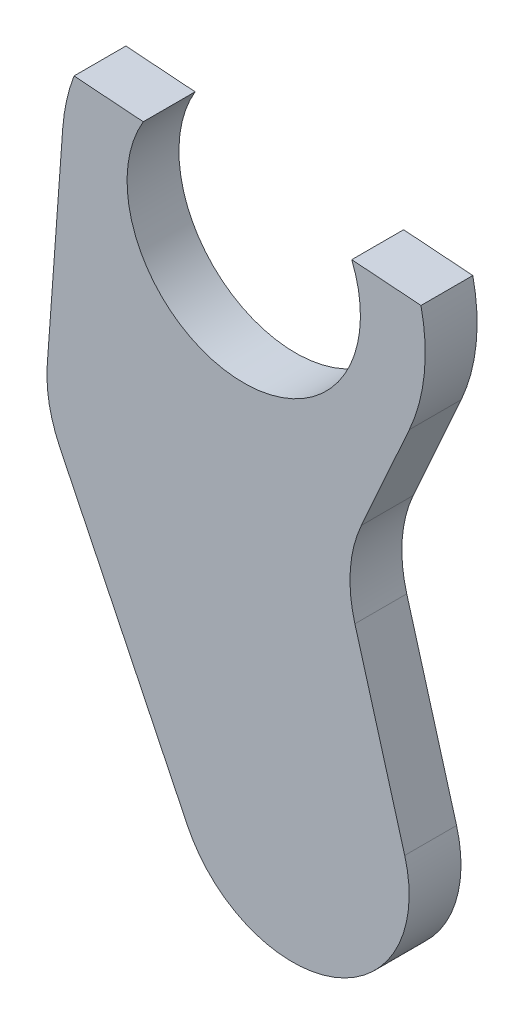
ISO-10303-21;
HEADER;
FILE_DESCRIPTION(('STEP AP214'),'2;1');
FILE_NAME('part.step','',(''),(''),'','','');
FILE_SCHEMA(('AUTOMOTIVE_DESIGN { 1 0 10303 214 1 1 1 1 }'));
ENDSEC;
DATA;
#1=APPLICATION_CONTEXT('core data for automotive mechanical design processes');
#2=APPLICATION_PROTOCOL_DEFINITION('international standard','automotive_design',2000,#1);
#3=PRODUCT_CONTEXT('',#1,'mechanical');
#4=PRODUCT('Part','Part','',(#3));
#5=PRODUCT_RELATED_PRODUCT_CATEGORY('part','',(#4));
#6=PRODUCT_DEFINITION_FORMATION('','',#4);
#7=PRODUCT_DEFINITION_CONTEXT('part definition',#1,'design');
#8=PRODUCT_DEFINITION('design','',#6,#7);
#9=PRODUCT_DEFINITION_SHAPE('','',#8);
#10=(LENGTH_UNIT() NAMED_UNIT(*) SI_UNIT(.MILLI.,.METRE.));
#11=(NAMED_UNIT(*) PLANE_ANGLE_UNIT() SI_UNIT($,.RADIAN.));
#12=(NAMED_UNIT(*) SI_UNIT($,.STERADIAN.) SOLID_ANGLE_UNIT());
#13=UNCERTAINTY_MEASURE_WITH_UNIT(LENGTH_MEASURE(1.E-05),#10,'distance_accuracy_value','');
#14=(GEOMETRIC_REPRESENTATION_CONTEXT(3) GLOBAL_UNCERTAINTY_ASSIGNED_CONTEXT((#13)) GLOBAL_UNIT_ASSIGNED_CONTEXT((#10,
#11,#12)) REPRESENTATION_CONTEXT('',''));
#15=CARTESIAN_POINT('',(0.,0.,0.));
#16=DIRECTION('',(0.,0.,1.));
#17=DIRECTION('',(1.,0.,0.));
#18=AXIS2_PLACEMENT_3D('',#15,#16,#17);
#19=CARTESIAN_POINT('',(-3.87501606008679,2.28784845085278,2.));
#20=DIRECTION('',(-0.0727199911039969,-0.997352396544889,0.));
#21=DIRECTION('',(0.99735239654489,-0.0727199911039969,0.));
#22=AXIS2_PLACEMENT_3D('',#19,#20,#21);
#23=PLANE('',#22);
#24=DIRECTION('',(-0.997352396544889,0.0727199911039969,0.));
#25=VECTOR('',#24,1.);
#26=CARTESIAN_POINT('',(-3.87501606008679,2.28784845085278,0.));
#27=LINE('',#26,#25);
#28=CARTESIAN_POINT('',(-3.87501606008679,2.28784845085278,0.));
#29=VERTEX_POINT('',#28);
#30=CARTESIAN_POINT('',(-6.54500328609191,2.48252532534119,0.));
#31=VERTEX_POINT('',#30);
#32=EDGE_CURVE('E94',#29,#31,#27,.T.);
#33=ORIENTED_EDGE('',*,*,#32,.T.);
#34=DIRECTION('',(0.,0.,-1.));
#35=VECTOR('',#34,1.);
#36=CARTESIAN_POINT('',(-6.54500328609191,2.48252532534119,2.));
#37=LINE('',#36,#35);
#38=CARTESIAN_POINT('',(-6.54500328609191,2.48252532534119,2.));
#39=VERTEX_POINT('',#38);
#40=EDGE_CURVE('E46',#39,#31,#37,.T.);
#41=ORIENTED_EDGE('',*,*,#40,.F.);
#42=DIRECTION('',(-0.997352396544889,0.0727199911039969,0.));
#43=VECTOR('',#42,1.);
#44=CARTESIAN_POINT('',(-3.87501606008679,2.28784845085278,2.));
#45=LINE('',#44,#43);
#46=CARTESIAN_POINT('',(-3.87501606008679,2.28784845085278,2.));
#47=VERTEX_POINT('',#46);
#48=EDGE_CURVE('E136',#47,#39,#45,.T.);
#49=ORIENTED_EDGE('',*,*,#48,.F.);
#50=DIRECTION('',(0.,0.,-1.));
#51=VECTOR('',#50,1.);
#52=CARTESIAN_POINT('',(-3.87501606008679,2.28784845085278,2.));
#53=LINE('',#52,#51);
#54=EDGE_CURVE('E11',#47,#29,#53,.T.);
#55=ORIENTED_EDGE('',*,*,#54,.T.);
#56=EDGE_LOOP('',(#33,#41,#49,#55));
#57=FACE_BOUND('',#56,.T.);
#58=ADVANCED_FACE('F36',(#57),#23,.F.);
#59=CARTESIAN_POINT('',(-1.97494798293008E-10,7.49122985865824E-11,2.));
#60=DIRECTION('',(0.,0.,-1.));
#61=DIRECTION('',(-1.,0.,0.));
#62=AXIS2_PLACEMENT_3D('',#59,#60,#61);
#63=CYLINDRICAL_SURFACE('',#62,7.00000000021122);
#64=CARTESIAN_POINT('',(-1.97494798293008E-10,7.49122985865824E-11,0.));
#65=DIRECTION('',(0.,0.,1.));
#66=DIRECTION('',(1.,0.,0.));
#67=AXIS2_PLACEMENT_3D('',#64,#65,#66);
#68=CIRCLE('',#67,7.00000000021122);
#69=CARTESIAN_POINT('',(-6.98146677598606,0.509039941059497,0.));
#70=VERTEX_POINT('',#69);
#71=EDGE_CURVE('E143',#31,#70,#68,.T.);
#72=ORIENTED_EDGE('',*,*,#71,.T.);
#73=DIRECTION('',(0.,0.,-1.));
#74=VECTOR('',#73,1.);
#75=CARTESIAN_POINT('',(-6.98146677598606,0.509039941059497,2.));
#76=LINE('',#75,#74);
#77=CARTESIAN_POINT('',(-6.98146677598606,0.509039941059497,2.));
#78=VERTEX_POINT('',#77);
#79=EDGE_CURVE('E140',#78,#70,#76,.T.);
#80=ORIENTED_EDGE('',*,*,#79,.F.);
#81=CARTESIAN_POINT('',(-1.97494798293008E-10,7.49122985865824E-11,2.));
#82=DIRECTION('',(0.,0.,1.));
#83=DIRECTION('',(1.,0.,0.));
#84=AXIS2_PLACEMENT_3D('',#81,#82,#83);
#85=CIRCLE('',#84,7.00000000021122);
#86=EDGE_CURVE('E130',#39,#78,#85,.T.);
#87=ORIENTED_EDGE('',*,*,#86,.F.);
#88=ORIENTED_EDGE('',*,*,#40,.T.);
#89=EDGE_LOOP('',(#72,#80,#87,#88));
#90=FACE_BOUND('',#89,.T.);
#91=ADVANCED_FACE('F141',(#90),#63,.T.);
#92=CARTESIAN_POINT('',(-6.98146677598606,0.509039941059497,2.));
#93=DIRECTION('',(0.997352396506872,-0.0727199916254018,0.));
#94=DIRECTION('',(0.0727199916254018,0.997352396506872,0.));
#95=AXIS2_PLACEMENT_3D('',#92,#93,#94);
#96=PLANE('',#95);
#97=DIRECTION('',(-0.0727199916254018,-0.997352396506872,0.));
#98=VECTOR('',#97,1.);
#99=CARTESIAN_POINT('',(-6.98146677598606,0.509039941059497,0.));
#100=LINE('',#99,#98);
#101=CARTESIAN_POINT('',(-7.57707677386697,-7.65973243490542,0.));
#102=VERTEX_POINT('',#101);
#103=EDGE_CURVE('E178',#70,#102,#100,.T.);
#104=ORIENTED_EDGE('',*,*,#103,.T.);
#105=DIRECTION('',(0.,0.,-1.));
#106=VECTOR('',#105,1.);
#107=CARTESIAN_POINT('',(-7.57707677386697,-7.65973243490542,2.));
#108=LINE('',#107,#106);
#109=CARTESIAN_POINT('',(-7.57707677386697,-7.65973243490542,2.));
#110=VERTEX_POINT('',#109);
#111=EDGE_CURVE('E146',#110,#102,#108,.T.);
#112=ORIENTED_EDGE('',*,*,#111,.F.);
#113=DIRECTION('',(-0.0727199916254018,-0.997352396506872,0.));
#114=VECTOR('',#113,1.);
#115=CARTESIAN_POINT('',(-6.98146677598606,0.509039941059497,2.));
#116=LINE('',#115,#114);
#117=EDGE_CURVE('E134',#78,#110,#116,.T.);
#118=ORIENTED_EDGE('',*,*,#117,.F.);
#119=ORIENTED_EDGE('',*,*,#79,.T.);
#120=EDGE_LOOP('',(#104,#112,#118,#119));
#121=FACE_BOUND('',#120,.T.);
#122=ADVANCED_FACE('F148',(#121),#96,.F.);
#123=CARTESIAN_POINT('',(-2.59031479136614,-8.02333239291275,2.));
#124=DIRECTION('',(0.,0.,-1.));
#125=DIRECTION('',(-1.,0.,0.));
#126=AXIS2_PLACEMENT_3D('',#123,#124,#125);
#127=CYLINDRICAL_SURFACE('',#126,4.99999999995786);
#128=CARTESIAN_POINT('',(-2.59031479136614,-8.02333239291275,0.));
#129=DIRECTION('',(0.,0.,1.));
#130=DIRECTION('',(1.,0.,0.));
#131=AXIS2_PLACEMENT_3D('',#128,#129,#130);
#132=CIRCLE('',#131,4.99999999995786);
#133=CARTESIAN_POINT('',(-7.09077732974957,-10.2018265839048,0.));
#134=VERTEX_POINT('',#133);
#135=EDGE_CURVE('E176',#102,#134,#132,.T.);
#136=ORIENTED_EDGE('',*,*,#135,.T.);
#137=DIRECTION('',(0.,0.,-1.));
#138=VECTOR('',#137,1.);
#139=CARTESIAN_POINT('',(-7.09077732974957,-10.2018265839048,2.));
#140=LINE('',#139,#138);
#141=CARTESIAN_POINT('',(-7.09077732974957,-10.2018265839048,2.));
#142=VERTEX_POINT('',#141);
#143=EDGE_CURVE('E184',#142,#134,#140,.T.);
#144=ORIENTED_EDGE('',*,*,#143,.F.);
#145=CARTESIAN_POINT('',(-2.59031479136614,-8.02333239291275,2.));
#146=DIRECTION('',(0.,0.,1.));
#147=DIRECTION('',(1.,0.,0.));
#148=AXIS2_PLACEMENT_3D('',#145,#146,#147);
#149=CIRCLE('',#148,4.99999999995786);
#150=EDGE_CURVE('E151',#110,#142,#149,.T.);
#151=ORIENTED_EDGE('',*,*,#150,.F.);
#152=ORIENTED_EDGE('',*,*,#111,.T.);
#153=EDGE_LOOP('',(#136,#144,#151,#152));
#154=FACE_BOUND('',#153,.T.);
#155=ADVANCED_FACE('F213',(#154),#127,.T.);
#156=CARTESIAN_POINT('',(-7.09077732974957,-10.2018265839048,2.));
#157=DIRECTION('',(0.900092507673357,0.435698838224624,0.));
#158=DIRECTION('',(-0.435698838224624,0.900092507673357,0.));
#159=AXIS2_PLACEMENT_3D('',#156,#157,#158);
#160=PLANE('',#159);
#161=DIRECTION('',(0.435698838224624,-0.900092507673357,0.));
#162=VECTOR('',#161,1.);
#163=CARTESIAN_POINT('',(-7.09077732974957,-10.2018265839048,0.));
#164=LINE('',#163,#162);
#165=CARTESIAN_POINT('',(-2.17133946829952,-20.3646931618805,0.));
#166=VERTEX_POINT('',#165);
#167=EDGE_CURVE('E174',#134,#166,#164,.T.);
#168=ORIENTED_EDGE('',*,*,#167,.T.);
#169=DIRECTION('',(0.,0.,-1.));
#170=VECTOR('',#169,1.);
#171=CARTESIAN_POINT('',(-2.17133946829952,-20.3646931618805,2.));
#172=LINE('',#171,#170);
#173=CARTESIAN_POINT('',(-2.17133946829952,-20.3646931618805,2.));
#174=VERTEX_POINT('',#173);
#175=EDGE_CURVE('E187',#174,#166,#172,.T.);
#176=ORIENTED_EDGE('',*,*,#175,.F.);
#177=DIRECTION('',(0.435698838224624,-0.900092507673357,0.));
#178=VECTOR('',#177,1.);
#179=CARTESIAN_POINT('',(-7.09077732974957,-10.2018265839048,2.));
#180=LINE('',#179,#178);
#181=EDGE_CURVE('E153',#142,#174,#180,.T.);
#182=ORIENTED_EDGE('',*,*,#181,.F.);
#183=ORIENTED_EDGE('',*,*,#143,.T.);
#184=EDGE_LOOP('',(#168,#176,#182,#183));
#185=FACE_BOUND('',#184,.T.);
#186=ADVANCED_FACE('F221',(#185),#160,.F.);
#187=CARTESIAN_POINT('',(1.87907681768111,-18.4040483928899,2.));
#188=DIRECTION('',(0.,0.,-1.));
#189=DIRECTION('',(-1.,0.,0.));
#190=AXIS2_PLACEMENT_3D('',#187,#188,#189);
#191=CYLINDRICAL_SURFACE('',#190,4.49999999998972);
#192=CARTESIAN_POINT('',(1.87907681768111,-18.4040483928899,0.));
#193=DIRECTION('',(0.,0.,1.));
#194=DIRECTION('',(1.,0.,0.));
#195=AXIS2_PLACEMENT_3D('',#192,#193,#194);
#196=CIRCLE('',#195,4.49999999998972);
#197=CARTESIAN_POINT('',(6.20842056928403,-17.1765376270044,0.));
#198=VERTEX_POINT('',#197);
#199=EDGE_CURVE('E172',#166,#198,#196,.T.);
#200=ORIENTED_EDGE('',*,*,#199,.T.);
#201=DIRECTION('',(0.,0.,-1.));
#202=VECTOR('',#201,1.);
#203=CARTESIAN_POINT('',(6.20842056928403,-17.1765376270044,2.));
#204=LINE('',#203,#202);
#205=CARTESIAN_POINT('',(6.20842056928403,-17.1765376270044,2.));
#206=VERTEX_POINT('',#205);
#207=EDGE_CURVE('E190',#206,#198,#204,.T.);
#208=ORIENTED_EDGE('',*,*,#207,.F.);
#209=CARTESIAN_POINT('',(1.87907681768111,-18.4040483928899,2.));
#210=DIRECTION('',(0.,0.,1.));
#211=DIRECTION('',(1.,0.,0.));
#212=AXIS2_PLACEMENT_3D('',#209,#210,#211);
#213=CIRCLE('',#212,4.49999999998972);
#214=EDGE_CURVE('E218',#174,#206,#213,.T.);
#215=ORIENTED_EDGE('',*,*,#214,.F.);
#216=ORIENTED_EDGE('',*,*,#175,.T.);
#217=EDGE_LOOP('',(#200,#208,#215,#216));
#218=FACE_BOUND('',#217,.T.);
#219=ADVANCED_FACE('F224',(#218),#191,.T.);
#220=CARTESIAN_POINT('',(6.20842056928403,-17.1765376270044,2.));
#221=DIRECTION('',(-0.962076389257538,-0.272780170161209,0.));
#222=DIRECTION('',(0.272780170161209,-0.962076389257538,0.));
#223=AXIS2_PLACEMENT_3D('',#220,#221,#222);
#224=PLANE('',#223);
#225=DIRECTION('',(-0.272780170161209,0.962076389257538,0.));
#226=VECTOR('',#225,1.);
#227=CARTESIAN_POINT('',(6.20842056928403,-17.1765376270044,0.));
#228=LINE('',#227,#226);
#229=CARTESIAN_POINT('',(4.28717341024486,-10.4004346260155,0.));
#230=VERTEX_POINT('',#229);
#231=EDGE_CURVE('E169',#198,#230,#228,.T.);
#232=ORIENTED_EDGE('',*,*,#231,.T.);
#233=DIRECTION('',(0.,0.,-1.));
#234=VECTOR('',#233,1.);
#235=CARTESIAN_POINT('',(4.28717341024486,-10.4004346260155,2.));
#236=LINE('',#235,#234);
#237=CARTESIAN_POINT('',(4.28717341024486,-10.4004346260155,2.));
#238=VERTEX_POINT('',#237);
#239=EDGE_CURVE('E193',#238,#230,#236,.T.);
#240=ORIENTED_EDGE('',*,*,#239,.F.);
#241=DIRECTION('',(-0.272780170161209,0.962076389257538,0.));
#242=VECTOR('',#241,1.);
#243=CARTESIAN_POINT('',(6.20842056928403,-17.1765376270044,2.));
#244=LINE('',#243,#242);
#245=EDGE_CURVE('E226',#206,#238,#244,.T.);
#246=ORIENTED_EDGE('',*,*,#245,.F.);
#247=ORIENTED_EDGE('',*,*,#207,.T.);
#248=EDGE_LOOP('',(#232,#240,#246,#247));
#249=FACE_BOUND('',#248,.T.);
#250=ADVANCED_FACE('F253',(#249),#224,.F.);
#251=CARTESIAN_POINT('',(9.0975553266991,-9.03653366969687,2.));
#252=DIRECTION('',(0.,0.,-1.));
#253=DIRECTION('',(-1.,0.,0.));
#254=AXIS2_PLACEMENT_3D('',#251,#252,#253);
#255=CYLINDRICAL_SURFACE('',#254,5.00000000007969);
#256=CARTESIAN_POINT('',(9.0975553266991,-9.03653366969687,0.));
#257=DIRECTION('',(0.,0.,1.));
#258=DIRECTION('',(1.,0.,0.));
#259=AXIS2_PLACEMENT_3D('',#256,#257,#258);
#260=CIRCLE('',#259,5.00000000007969);
#261=CARTESIAN_POINT('',(4.53589037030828,-6.98928848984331,0.));
#262=VERTEX_POINT('',#261);
#263=EDGE_CURVE('E166',#262,#230,#260,.T.);
#264=ORIENTED_EDGE('',*,*,#263,.F.);
#265=DIRECTION('',(0.,0.,-1.));
#266=VECTOR('',#265,1.);
#267=CARTESIAN_POINT('',(4.53589037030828,-6.98928848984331,2.));
#268=LINE('',#267,#266);
#269=CARTESIAN_POINT('',(4.53589037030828,-6.98928848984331,2.));
#270=VERTEX_POINT('',#269);
#271=EDGE_CURVE('E195',#270,#262,#268,.T.);
#272=ORIENTED_EDGE('',*,*,#271,.F.);
#273=CARTESIAN_POINT('',(9.0975553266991,-9.03653366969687,2.));
#274=DIRECTION('',(0.,0.,1.));
#275=DIRECTION('',(1.,0.,0.));
#276=AXIS2_PLACEMENT_3D('',#273,#274,#275);
#277=CIRCLE('',#276,5.00000000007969);
#278=EDGE_CURVE('E228',#270,#238,#277,.T.);
#279=ORIENTED_EDGE('',*,*,#278,.T.);
#280=ORIENTED_EDGE('',*,*,#239,.T.);
#281=EDGE_LOOP('',(#264,#272,#279,#280));
#282=FACE_BOUND('',#281,.T.);
#283=ADVANCED_FACE('F250',(#282),#255,.F.);
#284=CARTESIAN_POINT('',(4.53589037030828,-6.98928848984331,2.));
#285=DIRECTION('',(-0.912332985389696,0.409449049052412,0.));
#286=DIRECTION('',(-0.409449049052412,-0.912332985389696,0.));
#287=AXIS2_PLACEMENT_3D('',#284,#285,#286);
#288=PLANE('',#287);
#289=DIRECTION('',(0.409449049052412,0.912332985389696,0.));
#290=VECTOR('',#289,1.);
#291=CARTESIAN_POINT('',(4.53589037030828,-6.98928848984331,0.));
#292=LINE('',#291,#290);
#293=CARTESIAN_POINT('',(6.3863308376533,-2.86614330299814,0.));
#294=VERTEX_POINT('',#293);
#295=EDGE_CURVE('E164',#262,#294,#292,.T.);
#296=ORIENTED_EDGE('',*,*,#295,.T.);
#297=DIRECTION('',(0.,0.,-1.));
#298=VECTOR('',#297,1.);
#299=CARTESIAN_POINT('',(6.3863308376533,-2.86614330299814,2.));
#300=LINE('',#299,#298);
#301=CARTESIAN_POINT('',(6.3863308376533,-2.86614330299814,2.));
#302=VERTEX_POINT('',#301);
#303=EDGE_CURVE('E197',#302,#294,#300,.T.);
#304=ORIENTED_EDGE('',*,*,#303,.F.);
#305=DIRECTION('',(0.409449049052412,0.912332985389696,0.));
#306=VECTOR('',#305,1.);
#307=CARTESIAN_POINT('',(4.53589037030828,-6.98928848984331,2.));
#308=LINE('',#307,#306);
#309=EDGE_CURVE('E233',#270,#302,#308,.T.);
#310=ORIENTED_EDGE('',*,*,#309,.F.);
#311=ORIENTED_EDGE('',*,*,#271,.T.);
#312=EDGE_LOOP('',(#296,#304,#310,#311));
#313=FACE_BOUND('',#312,.T.);
#314=ADVANCED_FACE('F260',(#313),#288,.F.);
#315=CARTESIAN_POINT('',(-5.97416144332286E-08,4.01790545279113E-08,2.));
#316=DIRECTION('',(0.,0.,-1.));
#317=DIRECTION('',(-1.,0.,0.));
#318=AXIS2_PLACEMENT_3D('',#315,#316,#317);
#319=CYLINDRICAL_SURFACE('',#318,6.99999999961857);
#320=CARTESIAN_POINT('',(-5.97416144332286E-08,4.01790545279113E-08,0.));
#321=DIRECTION('',(0.,0.,1.));
#322=DIRECTION('',(1.,0.,0.));
#323=AXIS2_PLACEMENT_3D('',#320,#321,#322);
#324=CIRCLE('',#323,6.99999999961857);
#325=CARTESIAN_POINT('',(6.83588319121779,1.50688430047,0.));
#326=VERTEX_POINT('',#325);
#327=EDGE_CURVE('E162',#294,#326,#324,.T.);
#328=ORIENTED_EDGE('',*,*,#327,.T.);
#329=DIRECTION('',(0.,0.,-1.));
#330=VECTOR('',#329,1.);
#331=CARTESIAN_POINT('',(6.83588319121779,1.50688430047,2.));
#332=LINE('',#331,#330);
#333=CARTESIAN_POINT('',(6.83588319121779,1.50688430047,2.));
#334=VERTEX_POINT('',#333);
#335=EDGE_CURVE('E199',#334,#326,#332,.T.);
#336=ORIENTED_EDGE('',*,*,#335,.F.);
#337=CARTESIAN_POINT('',(-5.97416144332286E-08,4.01790545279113E-08,2.));
#338=DIRECTION('',(0.,0.,1.));
#339=DIRECTION('',(1.,0.,0.));
#340=AXIS2_PLACEMENT_3D('',#337,#338,#339);
#341=CIRCLE('',#340,6.99999999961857);
#342=EDGE_CURVE('E235',#302,#334,#341,.T.);
#343=ORIENTED_EDGE('',*,*,#342,.F.);
#344=ORIENTED_EDGE('',*,*,#303,.T.);
#345=EDGE_LOOP('',(#328,#336,#343,#344));
#346=FACE_BOUND('',#345,.T.);
#347=ADVANCED_FACE('F244',(#346),#319,.T.);
#348=CARTESIAN_POINT('',(6.83588319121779,1.50688430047,2.));
#349=DIRECTION('',(-0.0727196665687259,-0.997352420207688,0.));
#350=DIRECTION('',(0.997352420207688,-0.0727196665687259,0.));
#351=AXIS2_PLACEMENT_3D('',#348,#349,#350);
#352=PLANE('',#351);
#353=DIRECTION('',(-0.997352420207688,0.0727196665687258,0.));
#354=VECTOR('',#353,1.);
#355=CARTESIAN_POINT('',(6.83588319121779,1.50688430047,0.));
#356=LINE('',#355,#354);
#357=CARTESIAN_POINT('',(4.16589647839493,1.7015602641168,0.));
#358=VERTEX_POINT('',#357);
#359=EDGE_CURVE('E159',#326,#358,#356,.T.);
#360=ORIENTED_EDGE('',*,*,#359,.T.);
#361=DIRECTION('',(0.,0.,-1.));
#362=VECTOR('',#361,1.);
#363=CARTESIAN_POINT('',(4.16589647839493,1.7015602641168,2.));
#364=LINE('',#363,#362);
#365=CARTESIAN_POINT('',(4.16589647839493,1.7015602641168,2.));
#366=VERTEX_POINT('',#365);
#367=EDGE_CURVE('E40',#366,#358,#364,.T.);
#368=ORIENTED_EDGE('',*,*,#367,.F.);
#369=DIRECTION('',(-0.997352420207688,0.0727196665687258,0.));
#370=VECTOR('',#369,1.);
#371=CARTESIAN_POINT('',(6.83588319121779,1.50688430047,2.));
#372=LINE('',#371,#370);
#373=EDGE_CURVE('E237',#334,#366,#372,.T.);
#374=ORIENTED_EDGE('',*,*,#373,.F.);
#375=ORIENTED_EDGE('',*,*,#335,.T.);
#376=EDGE_LOOP('',(#360,#368,#374,#375));
#377=FACE_BOUND('',#376,.T.);
#378=ADVANCED_FACE('F206',(#377),#352,.F.);
#379=CARTESIAN_POINT('',(0.,6.45905551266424E-08,2.));
#380=DIRECTION('',(0.,0.,-1.));
#381=DIRECTION('',(-1.,0.,0.));
#382=AXIS2_PLACEMENT_3D('',#379,#380,#381);
#383=CYLINDRICAL_SURFACE('',#382,4.50000006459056);
#384=CARTESIAN_POINT('',(0.,6.45905551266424E-08,0.));
#385=DIRECTION('',(0.,0.,1.));
#386=DIRECTION('',(1.,0.,0.));
#387=AXIS2_PLACEMENT_3D('',#384,#385,#386);
#388=CIRCLE('',#387,4.50000006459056);
#389=EDGE_CURVE('E98',#29,#358,#388,.T.);
#390=ORIENTED_EDGE('',*,*,#389,.F.);
#391=ORIENTED_EDGE('',*,*,#54,.F.);
#392=CARTESIAN_POINT('',(0.,0.,2.));
#393=DIRECTION('',(0.,0.,1.));
#394=DIRECTION('',(1.,0.,0.));
#395=AXIS2_PLACEMENT_3D('',#392,#393,#394);
#396=CIRCLE('',#395,4.5);
#397=EDGE_CURVE('E102',#47,#366,#396,.T.);
#398=ORIENTED_EDGE('',*,*,#397,.T.);
#399=ORIENTED_EDGE('',*,*,#367,.T.);
#400=EDGE_LOOP('',(#390,#391,#398,#399));
#401=FACE_BOUND('',#400,.T.);
#402=ADVANCED_FACE('F38',(#401),#383,.F.);
#403=CARTESIAN_POINT('',(0.,0.,2.));
#404=DIRECTION('',(0.,0.,1.));
#405=DIRECTION('',(1.,0.,0.));
#406=AXIS2_PLACEMENT_3D('',#403,#404,#405);
#407=PLANE('',#406);
#408=ORIENTED_EDGE('',*,*,#397,.F.);
#409=ORIENTED_EDGE('',*,*,#48,.T.);
#410=ORIENTED_EDGE('',*,*,#86,.T.);
#411=ORIENTED_EDGE('',*,*,#117,.T.);
#412=ORIENTED_EDGE('',*,*,#150,.T.);
#413=ORIENTED_EDGE('',*,*,#181,.T.);
#414=ORIENTED_EDGE('',*,*,#214,.T.);
#415=ORIENTED_EDGE('',*,*,#245,.T.);
#416=ORIENTED_EDGE('',*,*,#278,.F.);
#417=ORIENTED_EDGE('',*,*,#309,.T.);
#418=ORIENTED_EDGE('',*,*,#342,.T.);
#419=ORIENTED_EDGE('',*,*,#373,.T.);
#420=EDGE_LOOP('',(#408,#409,#410,#411,#412,#413,#414,#415,#416,#417,#418,#419));
#421=FACE_BOUND('',#420,.T.);
#422=ADVANCED_FACE('F132',(#421),#407,.T.);
#423=CARTESIAN_POINT('',(0.,0.,0.));
#424=DIRECTION('',(0.,0.,1.));
#425=DIRECTION('',(1.,0.,0.));
#426=AXIS2_PLACEMENT_3D('',#423,#424,#425);
#427=PLANE('',#426);
#428=ORIENTED_EDGE('',*,*,#32,.F.);
#429=ORIENTED_EDGE('',*,*,#389,.T.);
#430=ORIENTED_EDGE('',*,*,#359,.F.);
#431=ORIENTED_EDGE('',*,*,#327,.F.);
#432=ORIENTED_EDGE('',*,*,#295,.F.);
#433=ORIENTED_EDGE('',*,*,#263,.T.);
#434=ORIENTED_EDGE('',*,*,#231,.F.);
#435=ORIENTED_EDGE('',*,*,#199,.F.);
#436=ORIENTED_EDGE('',*,*,#167,.F.);
#437=ORIENTED_EDGE('',*,*,#135,.F.);
#438=ORIENTED_EDGE('',*,*,#103,.F.);
#439=ORIENTED_EDGE('',*,*,#71,.F.);
#440=EDGE_LOOP('',(#428,#429,#430,#431,#432,#433,#434,#435,#436,#437,#438,#439));
#441=FACE_BOUND('',#440,.T.);
#442=ADVANCED_FACE('F209',(#441),#427,.F.);
#443=CLOSED_SHELL('',(#58,#91,#122,#155,#186,#219,#250,#283,#314,#347,#378,#402,#422,#442));
#444=MANIFOLD_SOLID_BREP('B2',#443);
#445=ADVANCED_BREP_SHAPE_REPRESENTATION('',(#18,#444),#14);
#446=SHAPE_DEFINITION_REPRESENTATION(#9,#445);
ENDSEC;
END-ISO-10303-21;
